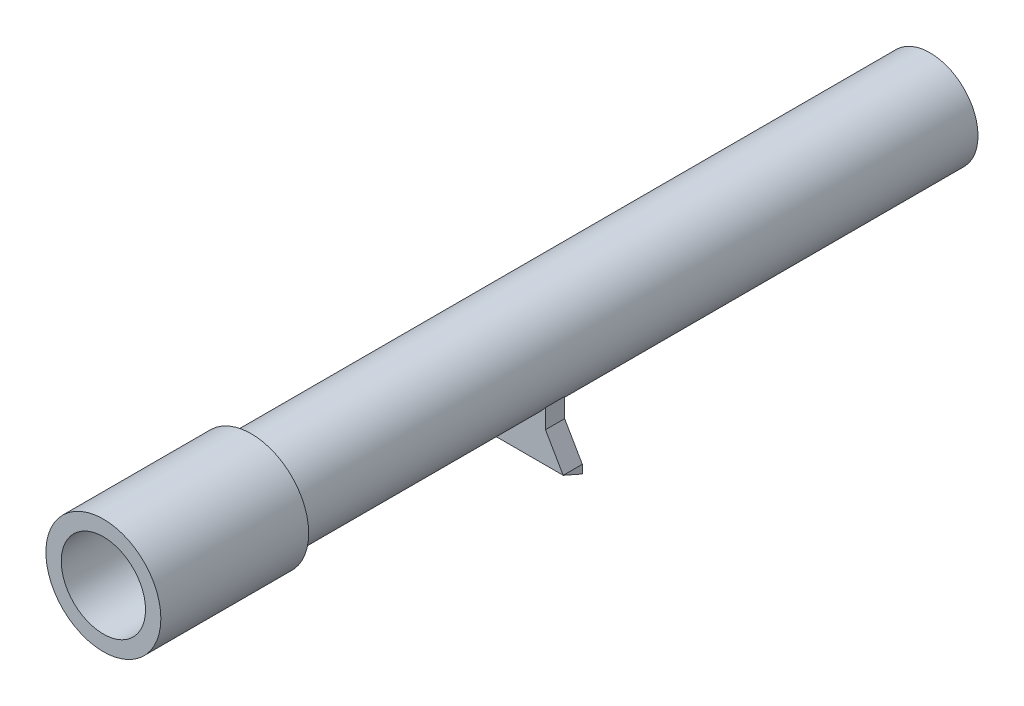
ISO-10303-21;
HEADER;
FILE_DESCRIPTION(('STEP AP214'),'2;1');
FILE_NAME('part.step','',(''),(''),'','','');
FILE_SCHEMA(('AUTOMOTIVE_DESIGN { 1 0 10303 214 1 1 1 1 }'));
ENDSEC;
DATA;
#1=APPLICATION_CONTEXT('core data for automotive mechanical design processes');
#2=APPLICATION_PROTOCOL_DEFINITION('international standard','automotive_design',2000,#1);
#3=PRODUCT_CONTEXT('',#1,'mechanical');
#4=PRODUCT('Part','Part','',(#3));
#5=PRODUCT_RELATED_PRODUCT_CATEGORY('part','',(#4));
#6=PRODUCT_DEFINITION_FORMATION('','',#4);
#7=PRODUCT_DEFINITION_CONTEXT('part definition',#1,'design');
#8=PRODUCT_DEFINITION('design','',#6,#7);
#9=PRODUCT_DEFINITION_SHAPE('','',#8);
#10=(LENGTH_UNIT() NAMED_UNIT(*) SI_UNIT(.MILLI.,.METRE.));
#11=(NAMED_UNIT(*) PLANE_ANGLE_UNIT() SI_UNIT($,.RADIAN.));
#12=(NAMED_UNIT(*) SI_UNIT($,.STERADIAN.) SOLID_ANGLE_UNIT());
#13=UNCERTAINTY_MEASURE_WITH_UNIT(LENGTH_MEASURE(1.E-05),#10,'distance_accuracy_value','');
#14=(GEOMETRIC_REPRESENTATION_CONTEXT(3) GLOBAL_UNCERTAINTY_ASSIGNED_CONTEXT((#13)) GLOBAL_UNIT_ASSIGNED_CONTEXT((#10,
#11,#12)) REPRESENTATION_CONTEXT('',''));
#15=CARTESIAN_POINT('',(0.,0.,0.));
#16=DIRECTION('',(0.,0.,1.));
#17=DIRECTION('',(1.,0.,0.));
#18=AXIS2_PLACEMENT_3D('',#15,#16,#17);
#19=CARTESIAN_POINT('',(0.,0.,225.));
#20=DIRECTION('',(0.,0.,-1.));
#21=DIRECTION('',(-1.,0.,0.));
#22=AXIS2_PLACEMENT_3D('',#19,#20,#21);
#23=CYLINDRICAL_SURFACE('',#22,15.875);
#24=DIRECTION('',(0.,0.,1.));
#25=VECTOR('',#24,1.);
#26=CARTESIAN_POINT('',(12.7,-9.525,133.825));
#27=LINE('',#26,#25);
#28=CARTESIAN_POINT('',(12.7,-9.525,133.825));
#29=VERTEX_POINT('',#28);
#30=CARTESIAN_POINT('',(12.7,-9.525,140.175));
#31=VERTEX_POINT('',#30);
#32=EDGE_CURVE('E162',#29,#31,#27,.T.);
#33=ORIENTED_EDGE('',*,*,#32,.F.);
#34=CARTESIAN_POINT('',(0.,0.,133.825));
#35=DIRECTION('',(0.,0.,-1.));
#36=DIRECTION('',(-1.,0.,0.));
#37=AXIS2_PLACEMENT_3D('',#34,#35,#36);
#38=CIRCLE('',#37,15.875);
#39=CARTESIAN_POINT('',(-12.7,-9.525,133.825));
#40=VERTEX_POINT('',#39);
#41=EDGE_CURVE('E11',#29,#40,#38,.T.);
#42=ORIENTED_EDGE('',*,*,#41,.T.);
#43=DIRECTION('',(0.,0.,1.));
#44=VECTOR('',#43,1.);
#45=CARTESIAN_POINT('',(-12.7,-9.525,133.825));
#46=LINE('',#45,#44);
#47=CARTESIAN_POINT('',(-12.7,-9.525,140.175));
#48=VERTEX_POINT('',#47);
#49=EDGE_CURVE('E171',#40,#48,#46,.T.);
#50=ORIENTED_EDGE('',*,*,#49,.T.);
#51=CARTESIAN_POINT('',(0.,0.,140.175));
#52=DIRECTION('',(0.,0.,-1.));
#53=DIRECTION('',(-1.,0.,0.));
#54=AXIS2_PLACEMENT_3D('',#51,#52,#53);
#55=CIRCLE('',#54,15.875);
#56=EDGE_CURVE('E47',#31,#48,#55,.T.);
#57=ORIENTED_EDGE('',*,*,#56,.F.);
#58=EDGE_LOOP('',(#33,#42,#50,#57));
#59=FACE_BOUND('',#58,.T.);
#60=CARTESIAN_POINT('',(0.,0.,225.));
#61=DIRECTION('',(0.,0.,1.));
#62=DIRECTION('',(1.,0.,0.));
#63=AXIS2_PLACEMENT_3D('',#60,#61,#62);
#64=CIRCLE('',#63,15.875);
#65=CARTESIAN_POINT('',(15.875,0.,225.));
#66=VERTEX_POINT('',#65);
#67=EDGE_CURVE('E191',#66,#66,#64,.T.);
#68=ORIENTED_EDGE('',*,*,#67,.F.);
#69=EDGE_LOOP('',(#68));
#70=FACE_BOUND('',#69,.T.);
#71=CARTESIAN_POINT('',(0.,0.,0.));
#72=DIRECTION('',(0.,0.,1.));
#73=DIRECTION('',(1.,0.,0.));
#74=AXIS2_PLACEMENT_3D('',#71,#72,#73);
#75=CIRCLE('',#74,15.875);
#76=CARTESIAN_POINT('',(15.875,0.,0.));
#77=VERTEX_POINT('',#76);
#78=EDGE_CURVE('E187',#77,#77,#75,.T.);
#79=ORIENTED_EDGE('',*,*,#78,.T.);
#80=EDGE_LOOP('',(#79));
#81=FACE_BOUND('',#80,.T.);
#82=ADVANCED_FACE('F39',(#59,#70,#81),#23,.T.);
#83=CARTESIAN_POINT('',(0.,0.,0.));
#84=DIRECTION('',(0.,0.,1.));
#85=DIRECTION('',(1.,0.,0.));
#86=AXIS2_PLACEMENT_3D('',#83,#84,#85);
#87=PLANE('',#86);
#88=ORIENTED_EDGE('',*,*,#78,.F.);
#89=EDGE_LOOP('',(#88));
#90=FACE_BOUND('',#89,.T.);
#91=ADVANCED_FACE('F222',(#90),#87,.F.);
#92=CARTESIAN_POINT('',(0.,0.,274.));
#93=DIRECTION('',(0.,0.,-1.));
#94=DIRECTION('',(-1.,0.,0.));
#95=AXIS2_PLACEMENT_3D('',#92,#93,#94);
#96=CYLINDRICAL_SURFACE('',#95,19.05);
#97=CARTESIAN_POINT('',(0.,0.,274.));
#98=DIRECTION('',(0.,0.,1.));
#99=DIRECTION('',(1.,0.,0.));
#100=AXIS2_PLACEMENT_3D('',#97,#98,#99);
#101=CIRCLE('',#100,19.05);
#102=CARTESIAN_POINT('',(19.05,0.,274.));
#103=VERTEX_POINT('',#102);
#104=EDGE_CURVE('E183',#103,#103,#101,.T.);
#105=ORIENTED_EDGE('',*,*,#104,.F.);
#106=EDGE_LOOP('',(#105));
#107=FACE_BOUND('',#106,.T.);
#108=CARTESIAN_POINT('',(0.,0.,225.));
#109=DIRECTION('',(0.,0.,1.));
#110=DIRECTION('',(1.,0.,0.));
#111=AXIS2_PLACEMENT_3D('',#108,#109,#110);
#112=CIRCLE('',#111,19.05);
#113=CARTESIAN_POINT('',(19.05,0.,225.));
#114=VERTEX_POINT('',#113);
#115=EDGE_CURVE('E182',#114,#114,#112,.T.);
#116=ORIENTED_EDGE('',*,*,#115,.T.);
#117=EDGE_LOOP('',(#116));
#118=FACE_BOUND('',#117,.T.);
#119=ADVANCED_FACE('F228',(#107,#118),#96,.T.);
#120=CARTESIAN_POINT('',(0.,0.,274.));
#121=DIRECTION('',(0.,0.,1.));
#122=DIRECTION('',(1.,0.,0.));
#123=AXIS2_PLACEMENT_3D('',#120,#121,#122);
#124=PLANE('',#123);
#125=CARTESIAN_POINT('',(0.,0.,274.));
#126=DIRECTION('',(0.,0.,1.));
#127=DIRECTION('',(1.,0.,0.));
#128=AXIS2_PLACEMENT_3D('',#125,#126,#127);
#129=CIRCLE('',#128,13.97);
#130=CARTESIAN_POINT('',(13.97,0.,274.));
#131=VERTEX_POINT('',#130);
#132=EDGE_CURVE('E105',#131,#131,#129,.T.);
#133=ORIENTED_EDGE('',*,*,#132,.F.);
#134=EDGE_LOOP('',(#133));
#135=FACE_BOUND('',#134,.T.);
#136=ORIENTED_EDGE('',*,*,#104,.T.);
#137=EDGE_LOOP('',(#136));
#138=FACE_BOUND('',#137,.T.);
#139=ADVANCED_FACE('F232',(#135,#138),#124,.T.);
#140=CARTESIAN_POINT('',(0.,0.,225.));
#141=DIRECTION('',(0.,0.,1.));
#142=DIRECTION('',(1.,0.,0.));
#143=AXIS2_PLACEMENT_3D('',#140,#141,#142);
#144=PLANE('',#143);
#145=ORIENTED_EDGE('',*,*,#67,.T.);
#146=EDGE_LOOP('',(#145));
#147=FACE_BOUND('',#146,.T.);
#148=ORIENTED_EDGE('',*,*,#115,.F.);
#149=EDGE_LOOP('',(#148));
#150=FACE_BOUND('',#149,.T.);
#151=ADVANCED_FACE('F236',(#147,#150),#144,.F.);
#152=CARTESIAN_POINT('',(0.,0.,133.825));
#153=DIRECTION('',(0.,0.,-1.));
#154=DIRECTION('',(-1.,0.,0.));
#155=AXIS2_PLACEMENT_3D('',#152,#153,#154);
#156=PLANE('',#155);
#157=DIRECTION('',(0.,-1.,0.));
#158=VECTOR('',#157,1.);
#159=CARTESIAN_POINT('',(-18.5658787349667,-28.8290668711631,133.825));
#160=LINE('',#159,#158);
#161=CARTESIAN_POINT('',(-18.5658787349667,-26.035,133.825));
#162=VERTEX_POINT('',#161);
#163=CARTESIAN_POINT('',(-18.5658787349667,-28.8290668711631,133.825));
#164=VERTEX_POINT('',#163);
#165=EDGE_CURVE('E98',#162,#164,#160,.T.);
#166=ORIENTED_EDGE('',*,*,#165,.F.);
#167=DIRECTION('',(0.500000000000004,0.866025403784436,0.));
#168=VECTOR('',#167,1.);
#169=CARTESIAN_POINT('',(-18.5658787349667,-26.035,133.825));
#170=LINE('',#169,#168);
#171=CARTESIAN_POINT('',(-12.7,-15.875,133.825));
#172=VERTEX_POINT('',#171);
#173=EDGE_CURVE('E142',#162,#172,#170,.T.);
#174=ORIENTED_EDGE('',*,*,#173,.T.);
#175=DIRECTION('',(0.,1.,0.));
#176=VECTOR('',#175,1.);
#177=CARTESIAN_POINT('',(-12.7,-9.525,133.825));
#178=LINE('',#177,#176);
#179=EDGE_CURVE('E158',#172,#40,#178,.T.);
#180=ORIENTED_EDGE('',*,*,#179,.T.);
#181=ORIENTED_EDGE('',*,*,#41,.F.);
#182=DIRECTION('',(0.,-1.,0.));
#183=VECTOR('',#182,1.);
#184=CARTESIAN_POINT('',(12.7,-9.525,133.825));
#185=LINE('',#184,#183);
#186=CARTESIAN_POINT('',(12.7,-15.875,133.825));
#187=VERTEX_POINT('',#186);
#188=EDGE_CURVE('E155',#29,#187,#185,.T.);
#189=ORIENTED_EDGE('',*,*,#188,.T.);
#190=DIRECTION('',(0.500000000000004,-0.866025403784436,0.));
#191=VECTOR('',#190,1.);
#192=CARTESIAN_POINT('',(12.7,-15.875,133.825));
#193=LINE('',#192,#191);
#194=CARTESIAN_POINT('',(18.5658787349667,-26.035,133.825));
#195=VERTEX_POINT('',#194);
#196=EDGE_CURVE('E130',#187,#195,#193,.T.);
#197=ORIENTED_EDGE('',*,*,#196,.T.);
#198=DIRECTION('',(0.,1.,0.));
#199=VECTOR('',#198,1.);
#200=CARTESIAN_POINT('',(18.5658787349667,-28.8290668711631,133.825));
#201=LINE('',#200,#199);
#202=CARTESIAN_POINT('',(18.5658787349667,-28.8290668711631,133.825));
#203=VERTEX_POINT('',#202);
#204=EDGE_CURVE('E101',#203,#195,#201,.T.);
#205=ORIENTED_EDGE('',*,*,#204,.F.);
#206=DIRECTION('',(-1.,0.,0.));
#207=VECTOR('',#206,1.);
#208=CARTESIAN_POINT('',(18.5658787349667,-28.8290668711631,133.825));
#209=LINE('',#208,#207);
#210=EDGE_CURVE('E93',#203,#164,#209,.T.);
#211=ORIENTED_EDGE('',*,*,#210,.T.);
#212=EDGE_LOOP('',(#166,#174,#180,#181,#189,#197,#205,#211));
#213=FACE_BOUND('',#212,.T.);
#214=ADVANCED_FACE('F95',(#213),#156,.T.);
#215=CARTESIAN_POINT('',(0.,0.,140.175));
#216=DIRECTION('',(0.,0.,-1.));
#217=DIRECTION('',(-1.,0.,0.));
#218=AXIS2_PLACEMENT_3D('',#215,#216,#217);
#219=PLANE('',#218);
#220=DIRECTION('',(0.,-1.,0.));
#221=VECTOR('',#220,1.);
#222=CARTESIAN_POINT('',(12.7,-9.525,140.175));
#223=LINE('',#222,#221);
#224=CARTESIAN_POINT('',(12.7,-15.875,140.175));
#225=VERTEX_POINT('',#224);
#226=EDGE_CURVE('E154',#31,#225,#223,.T.);
#227=ORIENTED_EDGE('',*,*,#226,.F.);
#228=ORIENTED_EDGE('',*,*,#56,.T.);
#229=DIRECTION('',(0.,1.,0.));
#230=VECTOR('',#229,1.);
#231=CARTESIAN_POINT('',(-12.7,-9.525,140.175));
#232=LINE('',#231,#230);
#233=CARTESIAN_POINT('',(-12.7,-15.875,140.175));
#234=VERTEX_POINT('',#233);
#235=EDGE_CURVE('E159',#234,#48,#232,.T.);
#236=ORIENTED_EDGE('',*,*,#235,.F.);
#237=DIRECTION('',(-0.500000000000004,-0.866025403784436,0.));
#238=VECTOR('',#237,1.);
#239=CARTESIAN_POINT('',(-18.5658787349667,-26.035,140.175));
#240=LINE('',#239,#238);
#241=CARTESIAN_POINT('',(-18.5658787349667,-26.035,140.175));
#242=VERTEX_POINT('',#241);
#243=EDGE_CURVE('E136',#234,#242,#240,.T.);
#244=ORIENTED_EDGE('',*,*,#243,.T.);
#245=DIRECTION('',(1.,0.,0.));
#246=VECTOR('',#245,1.);
#247=CARTESIAN_POINT('',(18.5658787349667,-26.035,140.175));
#248=LINE('',#247,#246);
#249=CARTESIAN_POINT('',(18.5658787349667,-26.035,140.175));
#250=VERTEX_POINT('',#249);
#251=EDGE_CURVE('E110',#242,#250,#248,.T.);
#252=ORIENTED_EDGE('',*,*,#251,.T.);
#253=DIRECTION('',(-0.500000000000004,0.866025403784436,0.));
#254=VECTOR('',#253,1.);
#255=CARTESIAN_POINT('',(12.7,-15.875,140.175));
#256=LINE('',#255,#254);
#257=EDGE_CURVE('E139',#250,#225,#256,.T.);
#258=ORIENTED_EDGE('',*,*,#257,.T.);
#259=EDGE_LOOP('',(#227,#228,#236,#244,#252,#258));
#260=FACE_BOUND('',#259,.T.);
#261=ADVANCED_FACE('F201',(#260),#219,.F.);
#262=CARTESIAN_POINT('',(12.7,-9.525,133.825));
#263=DIRECTION('',(-1.,0.,0.));
#264=DIRECTION('',(0.,0.,1.));
#265=AXIS2_PLACEMENT_3D('',#262,#263,#264);
#266=PLANE('',#265);
#267=ORIENTED_EDGE('',*,*,#226,.T.);
#268=DIRECTION('',(0.,0.,1.));
#269=VECTOR('',#268,1.);
#270=CARTESIAN_POINT('',(12.7,-15.875,133.825));
#271=LINE('',#270,#269);
#272=EDGE_CURVE('E178',#187,#225,#271,.T.);
#273=ORIENTED_EDGE('',*,*,#272,.F.);
#274=ORIENTED_EDGE('',*,*,#188,.F.);
#275=ORIENTED_EDGE('',*,*,#32,.T.);
#276=EDGE_LOOP('',(#267,#273,#274,#275));
#277=FACE_BOUND('',#276,.T.);
#278=ADVANCED_FACE('F219',(#277),#266,.F.);
#279=CARTESIAN_POINT('',(-12.7,-9.525,133.825));
#280=DIRECTION('',(1.,0.,0.));
#281=DIRECTION('',(0.,0.,-1.));
#282=AXIS2_PLACEMENT_3D('',#279,#280,#281);
#283=PLANE('',#282);
#284=ORIENTED_EDGE('',*,*,#235,.T.);
#285=ORIENTED_EDGE('',*,*,#49,.F.);
#286=ORIENTED_EDGE('',*,*,#179,.F.);
#287=DIRECTION('',(0.,0.,1.));
#288=VECTOR('',#287,1.);
#289=CARTESIAN_POINT('',(-12.7,-15.875,133.825));
#290=LINE('',#289,#288);
#291=EDGE_CURVE('E174',#172,#234,#290,.T.);
#292=ORIENTED_EDGE('',*,*,#291,.T.);
#293=EDGE_LOOP('',(#284,#285,#286,#292));
#294=FACE_BOUND('',#293,.T.);
#295=ADVANCED_FACE('F204',(#294),#283,.F.);
#296=CARTESIAN_POINT('',(-18.5658787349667,-26.035,178.6716623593));
#297=DIRECTION('',(-0.866025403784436,0.500000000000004,0.));
#298=DIRECTION('',(-0.500000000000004,-0.866025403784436,0.));
#299=AXIS2_PLACEMENT_3D('',#296,#297,#298);
#300=PLANE('',#299);
#301=ORIENTED_EDGE('',*,*,#243,.F.);
#302=ORIENTED_EDGE('',*,*,#291,.F.);
#303=ORIENTED_EDGE('',*,*,#173,.F.);
#304=DIRECTION('',(0.,0.,-1.));
#305=VECTOR('',#304,1.);
#306=CARTESIAN_POINT('',(-18.5658787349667,-26.035,178.6716623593));
#307=LINE('',#306,#305);
#308=EDGE_CURVE('E118',#242,#162,#307,.T.);
#309=ORIENTED_EDGE('',*,*,#308,.F.);
#310=EDGE_LOOP('',(#301,#302,#303,#309));
#311=FACE_BOUND('',#310,.T.);
#312=ADVANCED_FACE('F208',(#311),#300,.T.);
#313=CARTESIAN_POINT('',(12.7,-15.875,178.6716623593));
#314=DIRECTION('',(0.866025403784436,0.500000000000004,0.));
#315=DIRECTION('',(-0.500000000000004,0.866025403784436,0.));
#316=AXIS2_PLACEMENT_3D('',#313,#314,#315);
#317=PLANE('',#316);
#318=ORIENTED_EDGE('',*,*,#257,.F.);
#319=DIRECTION('',(0.,0.,-1.));
#320=VECTOR('',#319,1.);
#321=CARTESIAN_POINT('',(18.5658787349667,-26.035,178.6716623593));
#322=LINE('',#321,#320);
#323=EDGE_CURVE('E145',#250,#195,#322,.T.);
#324=ORIENTED_EDGE('',*,*,#323,.T.);
#325=ORIENTED_EDGE('',*,*,#196,.F.);
#326=ORIENTED_EDGE('',*,*,#272,.T.);
#327=EDGE_LOOP('',(#318,#324,#325,#326));
#328=FACE_BOUND('',#327,.T.);
#329=ADVANCED_FACE('F215',(#328),#317,.T.);
#330=CARTESIAN_POINT('',(0.,0.,254.));
#331=DIRECTION('',(0.,0.,1.));
#332=DIRECTION('',(1.,0.,0.));
#333=AXIS2_PLACEMENT_3D('',#330,#331,#332);
#334=CYLINDRICAL_SURFACE('',#333,13.97);
#335=CARTESIAN_POINT('',(0.,0.,254.));
#336=DIRECTION('',(0.,0.,1.));
#337=DIRECTION('',(1.,0.,0.));
#338=AXIS2_PLACEMENT_3D('',#335,#336,#337);
#339=CIRCLE('',#338,13.97);
#340=CARTESIAN_POINT('',(13.97,0.,254.));
#341=VERTEX_POINT('',#340);
#342=EDGE_CURVE('E126',#341,#341,#339,.T.);
#343=ORIENTED_EDGE('',*,*,#342,.F.);
#344=EDGE_LOOP('',(#343));
#345=FACE_BOUND('',#344,.T.);
#346=ORIENTED_EDGE('',*,*,#132,.T.);
#347=EDGE_LOOP('',(#346));
#348=FACE_BOUND('',#347,.T.);
#349=ADVANCED_FACE('F253',(#345,#348),#334,.F.);
#350=CARTESIAN_POINT('',(0.,0.,254.));
#351=DIRECTION('',(0.,0.,1.));
#352=DIRECTION('',(1.,0.,0.));
#353=AXIS2_PLACEMENT_3D('',#350,#351,#352);
#354=PLANE('',#353);
#355=ORIENTED_EDGE('',*,*,#342,.T.);
#356=EDGE_LOOP('',(#355));
#357=FACE_BOUND('',#356,.T.);
#358=ADVANCED_FACE('F258',(#357),#354,.T.);
#359=CARTESIAN_POINT('',(18.5658787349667,-26.035,140.175));
#360=DIRECTION('',(0.,0.91531147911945,-0.402746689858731));
#361=DIRECTION('',(0.,0.402746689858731,0.91531147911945));
#362=AXIS2_PLACEMENT_3D('',#359,#360,#361);
#363=PLANE('',#362);
#364=DIRECTION('',(0.,-0.402746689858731,-0.91531147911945));
#365=VECTOR('',#364,1.);
#366=CARTESIAN_POINT('',(18.5658787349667,-26.035,140.175));
#367=LINE('',#366,#365);
#368=EDGE_CURVE('E114',#250,#203,#367,.T.);
#369=ORIENTED_EDGE('',*,*,#368,.F.);
#370=ORIENTED_EDGE('',*,*,#251,.F.);
#371=DIRECTION('',(0.,0.402746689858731,0.91531147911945));
#372=VECTOR('',#371,1.);
#373=CARTESIAN_POINT('',(-18.5658787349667,-26.035,140.175));
#374=LINE('',#373,#372);
#375=EDGE_CURVE('E108',#164,#242,#374,.T.);
#376=ORIENTED_EDGE('',*,*,#375,.F.);
#377=ORIENTED_EDGE('',*,*,#210,.F.);
#378=EDGE_LOOP('',(#369,#370,#376,#377));
#379=FACE_BOUND('',#378,.T.);
#380=ADVANCED_FACE('F109',(#379),#363,.F.);
#381=CARTESIAN_POINT('',(18.5658787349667,0.,0.));
#382=DIRECTION('',(-1.,0.,0.));
#383=DIRECTION('',(0.,0.,1.));
#384=AXIS2_PLACEMENT_3D('',#381,#382,#383);
#385=PLANE('',#384);
#386=ORIENTED_EDGE('',*,*,#323,.F.);
#387=ORIENTED_EDGE('',*,*,#368,.T.);
#388=ORIENTED_EDGE('',*,*,#204,.T.);
#389=EDGE_LOOP('',(#386,#387,#388));
#390=FACE_BOUND('',#389,.T.);
#391=ADVANCED_FACE('F212',(#390),#385,.F.);
#392=CARTESIAN_POINT('',(-18.5658787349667,0.,0.));
#393=DIRECTION('',(1.,0.,0.));
#394=DIRECTION('',(0.,0.,-1.));
#395=AXIS2_PLACEMENT_3D('',#392,#393,#394);
#396=PLANE('',#395);
#397=ORIENTED_EDGE('',*,*,#165,.T.);
#398=ORIENTED_EDGE('',*,*,#375,.T.);
#399=ORIENTED_EDGE('',*,*,#308,.T.);
#400=EDGE_LOOP('',(#397,#398,#399));
#401=FACE_BOUND('',#400,.T.);
#402=ADVANCED_FACE('F116',(#401),#396,.F.);
#403=CLOSED_SHELL('',(#82,#91,#119,#139,#151,#214,#261,#278,#295,#312,#329,#349,#358,#380,#391,#402));
#404=MANIFOLD_SOLID_BREP('B2',#403);
#405=ADVANCED_BREP_SHAPE_REPRESENTATION('',(#18,#404),#14);
#406=SHAPE_DEFINITION_REPRESENTATION(#9,#405);
ENDSEC;
END-ISO-10303-21;
